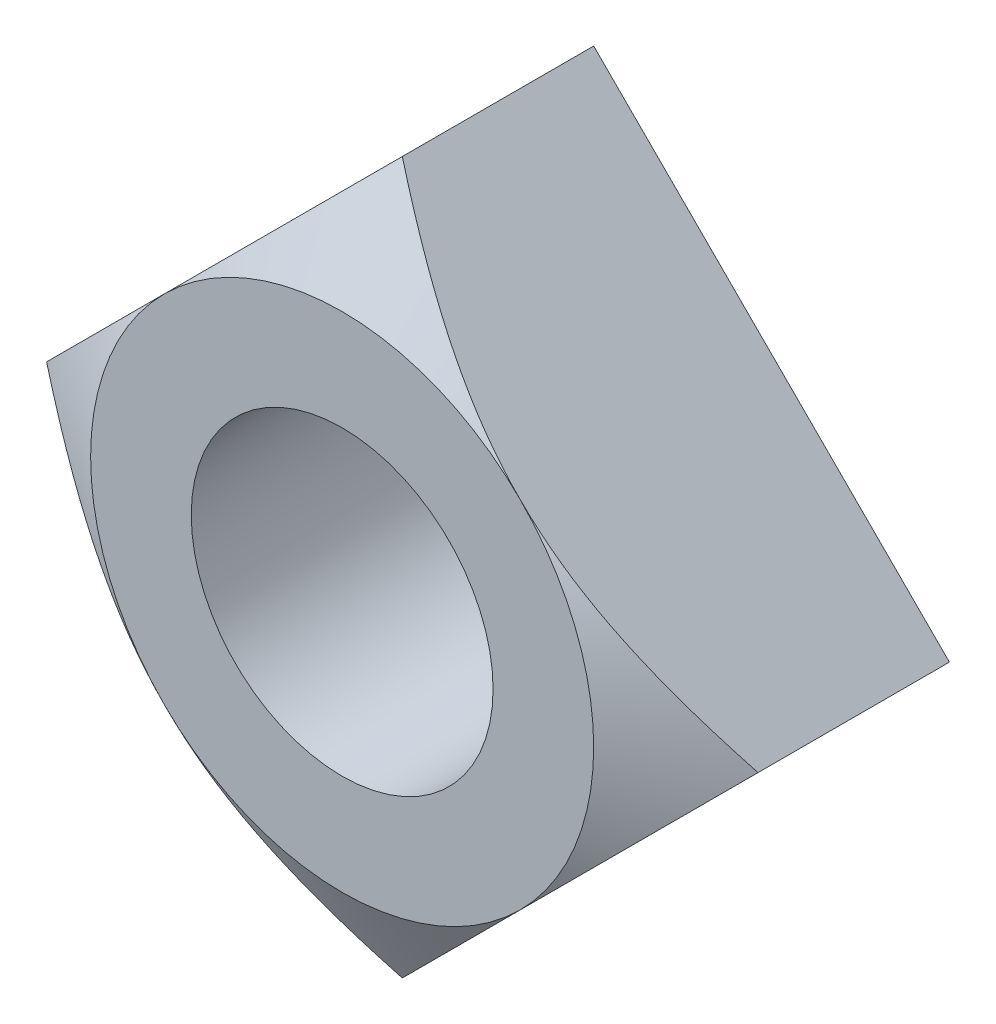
from build123d import *

# Parameters (mm, degrees)
EXTRUDE1_DEPTH     = 5
SKETCH3_R          = 3
CUT_EXTRUDE1_DEPTH = 12.180339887


with BuildPart() as part:
    # Sketch1 → Extrude1 (new body)
    with BuildSketch(Plane.XY):
        Polygon((0, 7.071067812), (-7.071067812, 0), (0, -7.071067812), (7.071067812, 0), align=None)
    extrude(amount=EXTRUDE1_DEPTH)

    # Sketch2 → Cut-Revolve1 (revolve, cut)
    with BuildSketch(Plane(origin=(0, 0, 0), x_dir=(-0.7071067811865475, -0.7071067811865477, 0), z_dir=(-0.7071067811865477, 0.7071067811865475, 0))):
        Polygon((-5, 5), (-10, 5), (-10, 2.113248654), align=None)
    revolve(axis=Axis((0, 0, 0), (0, 0, 1)), mode=Mode.SUBTRACT)

    # Sketch3 → Cut-Extrude1 (cut, through all)
    with BuildSketch(Plane.XY.offset(5)):
        Circle(SKETCH3_R)
    extrude(amount=-CUT_EXTRUDE1_DEPTH, mode=Mode.SUBTRACT)


solid = part.part
